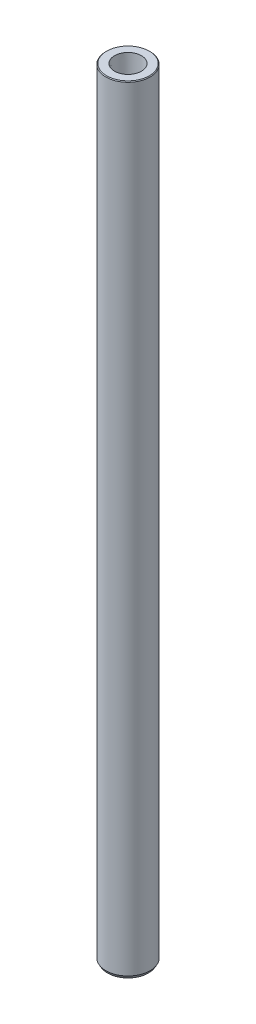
ISO-10303-21;
HEADER;
FILE_DESCRIPTION(('STEP AP214'),'2;1');
FILE_NAME('part.step','',(''),(''),'','','');
FILE_SCHEMA(('AUTOMOTIVE_DESIGN { 1 0 10303 214 1 1 1 1 }'));
ENDSEC;
DATA;
#1=APPLICATION_CONTEXT('core data for automotive mechanical design processes');
#2=APPLICATION_PROTOCOL_DEFINITION('international standard','automotive_design',2000,#1);
#3=PRODUCT_CONTEXT('',#1,'mechanical');
#4=PRODUCT('Part','Part','',(#3));
#5=PRODUCT_RELATED_PRODUCT_CATEGORY('part','',(#4));
#6=PRODUCT_DEFINITION_FORMATION('','',#4);
#7=PRODUCT_DEFINITION_CONTEXT('part definition',#1,'design');
#8=PRODUCT_DEFINITION('design','',#6,#7);
#9=PRODUCT_DEFINITION_SHAPE('','',#8);
#10=(LENGTH_UNIT() NAMED_UNIT(*) SI_UNIT(.MILLI.,.METRE.));
#11=(NAMED_UNIT(*) PLANE_ANGLE_UNIT() SI_UNIT($,.RADIAN.));
#12=(NAMED_UNIT(*) SI_UNIT($,.STERADIAN.) SOLID_ANGLE_UNIT());
#13=UNCERTAINTY_MEASURE_WITH_UNIT(LENGTH_MEASURE(1.E-05),#10,'distance_accuracy_value','');
#14=(GEOMETRIC_REPRESENTATION_CONTEXT(3) GLOBAL_UNCERTAINTY_ASSIGNED_CONTEXT((#13)) GLOBAL_UNIT_ASSIGNED_CONTEXT((#10,
#11,#12)) REPRESENTATION_CONTEXT('',''));
#15=CARTESIAN_POINT('',(0.,0.,0.));
#16=DIRECTION('',(0.,0.,1.));
#17=DIRECTION('',(1.,0.,0.));
#18=AXIS2_PLACEMENT_3D('',#15,#16,#17);
#19=CARTESIAN_POINT('',(0.,264.,0.));
#20=DIRECTION('',(0.,-1.,0.));
#21=DIRECTION('',(0.,0.,-1.));
#22=AXIS2_PLACEMENT_3D('',#19,#20,#21);
#23=CYLINDRICAL_SURFACE('',#22,7.5);
#24=CARTESIAN_POINT('',(0.,263.75,0.));
#25=DIRECTION('',(0.,1.,0.));
#26=DIRECTION('',(0.,0.,1.));
#27=AXIS2_PLACEMENT_3D('',#24,#25,#26);
#28=CIRCLE('',#27,7.5);
#29=CARTESIAN_POINT('',(0.,263.75,7.5));
#30=VERTEX_POINT('',#29);
#31=EDGE_CURVE('E9183',#30,#30,#28,.F.);
#32=ORIENTED_EDGE('',*,*,#31,.T.);
#33=EDGE_LOOP('',(#32));
#34=FACE_BOUND('',#33,.T.);
#35=CARTESIAN_POINT('',(0.,1.00000000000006,0.));
#36=DIRECTION('',(0.,1.,0.));
#37=DIRECTION('',(0.,0.,1.));
#38=AXIS2_PLACEMENT_3D('',#35,#36,#37);
#39=CIRCLE('',#38,7.5);
#40=CARTESIAN_POINT('',(0.,1.00000000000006,7.5));
#41=VERTEX_POINT('',#40);
#42=EDGE_CURVE('E9194',#41,#41,#39,.T.);
#43=ORIENTED_EDGE('',*,*,#42,.T.);
#44=EDGE_LOOP('',(#43));
#45=FACE_BOUND('',#44,.T.);
#46=ADVANCED_FACE('F9172',(#34,#45),#23,.T.);
#47=CARTESIAN_POINT('',(0.,264.,0.));
#48=DIRECTION('',(0.,1.,0.));
#49=DIRECTION('',(0.,0.,1.));
#50=AXIS2_PLACEMENT_3D('',#47,#48,#49);
#51=PLANE('',#50);
#52=CARTESIAN_POINT('',(0.,264.,0.));
#53=DIRECTION('',(0.,1.,0.));
#54=DIRECTION('',(0.,0.,1.));
#55=AXIS2_PLACEMENT_3D('',#52,#53,#54);
#56=CIRCLE('',#55,4.5735);
#57=CARTESIAN_POINT('',(0.,264.,4.5735));
#58=VERTEX_POINT('',#57);
#59=EDGE_CURVE('E9206',#58,#58,#56,.T.);
#60=ORIENTED_EDGE('',*,*,#59,.F.);
#61=EDGE_LOOP('',(#60));
#62=FACE_BOUND('',#61,.T.);
#63=CARTESIAN_POINT('',(0.,264.,0.));
#64=DIRECTION('',(0.,1.,0.));
#65=DIRECTION('',(0.,0.,1.));
#66=AXIS2_PLACEMENT_3D('',#63,#64,#65);
#67=CIRCLE('',#66,7.25000000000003);
#68=CARTESIAN_POINT('',(0.,264.,7.25000000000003));
#69=VERTEX_POINT('',#68);
#70=EDGE_CURVE('E9188',#69,#69,#67,.T.);
#71=ORIENTED_EDGE('',*,*,#70,.T.);
#72=EDGE_LOOP('',(#71));
#73=FACE_BOUND('',#72,.T.);
#74=ADVANCED_FACE('F9212',(#62,#73),#51,.T.);
#75=CARTESIAN_POINT('',(0.,0.,0.));
#76=DIRECTION('',(0.,1.,0.));
#77=DIRECTION('',(0.,0.,1.));
#78=AXIS2_PLACEMENT_3D('',#75,#76,#77);
#79=PLANE('',#78);
#80=CARTESIAN_POINT('',(0.,0.,0.));
#81=DIRECTION('',(0.,1.,0.));
#82=DIRECTION('',(0.,0.,1.));
#83=AXIS2_PLACEMENT_3D('',#80,#81,#82);
#84=CIRCLE('',#83,4.75);
#85=CARTESIAN_POINT('',(0.,0.,4.75));
#86=VERTEX_POINT('',#85);
#87=EDGE_CURVE('E10',#86,#86,#84,.T.);
#88=ORIENTED_EDGE('',*,*,#87,.T.);
#89=EDGE_LOOP('',(#88));
#90=FACE_BOUND('',#89,.T.);
#91=CARTESIAN_POINT('',(0.,0.,0.));
#92=DIRECTION('',(0.,1.,0.));
#93=DIRECTION('',(0.,0.,1.));
#94=AXIS2_PLACEMENT_3D('',#91,#92,#93);
#95=CIRCLE('',#94,6.92264973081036);
#96=CARTESIAN_POINT('',(0.,0.,6.92264973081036));
#97=VERTEX_POINT('',#96);
#98=EDGE_CURVE('E9191',#97,#97,#95,.F.);
#99=ORIENTED_EDGE('',*,*,#98,.T.);
#100=EDGE_LOOP('',(#99));
#101=FACE_BOUND('',#100,.T.);
#102=ADVANCED_FACE('F9215',(#90,#101),#79,.F.);
#103=CARTESIAN_POINT('',(0.,1.00000000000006,0.));
#104=DIRECTION('',(0.,1.,0.));
#105=DIRECTION('',(0.,0.,1.));
#106=AXIS2_PLACEMENT_3D('',#103,#104,#105);
#107=CONICAL_SURFACE('',#106,7.5,0.523598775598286);
#108=ORIENTED_EDGE('',*,*,#98,.F.);
#109=EDGE_LOOP('',(#108));
#110=FACE_BOUND('',#109,.T.);
#111=ORIENTED_EDGE('',*,*,#42,.F.);
#112=EDGE_LOOP('',(#111));
#113=FACE_BOUND('',#112,.T.);
#114=ADVANCED_FACE('F9244',(#110,#113),#107,.T.);
#115=CARTESIAN_POINT('',(0.,17.,0.));
#116=DIRECTION('',(0.,-1.,0.));
#117=DIRECTION('',(0.,0.,-1.));
#118=AXIS2_PLACEMENT_3D('',#115,#116,#117);
#119=CYLINDRICAL_SURFACE('',#118,4.5);
#120=CARTESIAN_POINT('',(0.,0.25,0.));
#121=DIRECTION('',(0.,1.,0.));
#122=DIRECTION('',(0.,0.,1.));
#123=AXIS2_PLACEMENT_3D('',#120,#121,#122);
#124=CIRCLE('',#123,4.5);
#125=CARTESIAN_POINT('',(0.,0.25,4.5));
#126=VERTEX_POINT('',#125);
#127=EDGE_CURVE('E9179',#126,#126,#124,.F.);
#128=ORIENTED_EDGE('',*,*,#127,.T.);
#129=EDGE_LOOP('',(#128));
#130=FACE_BOUND('',#129,.T.);
#131=CARTESIAN_POINT('',(0.,17.,0.));
#132=DIRECTION('',(0.,-1.,0.));
#133=DIRECTION('',(0.,0.,-1.));
#134=AXIS2_PLACEMENT_3D('',#131,#132,#133);
#135=CIRCLE('',#134,4.5);
#136=CARTESIAN_POINT('',(0.,17.,-4.5));
#137=VERTEX_POINT('',#136);
#138=EDGE_CURVE('E9197',#137,#137,#135,.T.);
#139=ORIENTED_EDGE('',*,*,#138,.F.);
#140=EDGE_LOOP('',(#139));
#141=FACE_BOUND('',#140,.T.);
#142=ADVANCED_FACE('F9233',(#130,#141),#119,.F.);
#143=CARTESIAN_POINT('',(0.,17.,0.));
#144=DIRECTION('',(0.,-1.,0.));
#145=DIRECTION('',(0.,0.,-1.));
#146=AXIS2_PLACEMENT_3D('',#143,#144,#145);
#147=PLANE('',#146);
#148=ORIENTED_EDGE('',*,*,#138,.T.);
#149=EDGE_LOOP('',(#148));
#150=FACE_BOUND('',#149,.T.);
#151=ADVANCED_FACE('F9221',(#150),#147,.T.);
#152=CARTESIAN_POINT('',(0.,264.,0.));
#153=DIRECTION('',(0.,-1.,0.));
#154=DIRECTION('',(0.,0.,-1.));
#155=AXIS2_PLACEMENT_3D('',#152,#153,#154);
#156=CONICAL_SURFACE('',#155,7.25000000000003,0.78539816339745);
#157=ORIENTED_EDGE('',*,*,#31,.F.);
#158=EDGE_LOOP('',(#157));
#159=FACE_BOUND('',#158,.T.);
#160=ORIENTED_EDGE('',*,*,#70,.F.);
#161=EDGE_LOOP('',(#160));
#162=FACE_BOUND('',#161,.T.);
#163=ADVANCED_FACE('F9218',(#159,#162),#156,.T.);
#164=CARTESIAN_POINT('',(0.,0.25,0.));
#165=DIRECTION('',(0.,-1.,0.));
#166=DIRECTION('',(0.,0.,-1.));
#167=AXIS2_PLACEMENT_3D('',#164,#165,#166);
#168=CONICAL_SURFACE('',#167,4.5,0.78539816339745);
#169=ORIENTED_EDGE('',*,*,#87,.F.);
#170=EDGE_LOOP('',(#169));
#171=FACE_BOUND('',#170,.T.);
#172=ORIENTED_EDGE('',*,*,#127,.F.);
#173=EDGE_LOOP('',(#172));
#174=FACE_BOUND('',#173,.T.);
#175=ADVANCED_FACE('F9220',(#171,#174),#168,.F.);
#176=CARTESIAN_POINT('',(3.95,256.6,0.));
#177=DIRECTION('',(0.,-1.,0.));
#178=DIRECTION('',(0.,0.,-1.));
#179=AXIS2_PLACEMENT_3D('',#176,#177,#178);
#180=PLANE('',#179);
#181=CARTESIAN_POINT('',(0.,256.6,0.));
#182=DIRECTION('',(0.,1.,0.));
#183=DIRECTION('',(0.,0.,1.));
#184=AXIS2_PLACEMENT_3D('',#181,#182,#183);
#185=CIRCLE('',#184,4.34249700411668);
#186=CARTESIAN_POINT('',(0.,256.6,4.34249700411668));
#187=VERTEX_POINT('',#186);
#188=EDGE_CURVE('E9203',#187,#187,#185,.T.);
#189=ORIENTED_EDGE('',*,*,#188,.T.);
#190=EDGE_LOOP('',(#189));
#191=FACE_BOUND('',#190,.T.);
#192=CARTESIAN_POINT('',(0.,256.6,0.));
#193=DIRECTION('',(0.,-1.,0.));
#194=DIRECTION('',(0.,0.,-1.));
#195=AXIS2_PLACEMENT_3D('',#192,#193,#194);
#196=CIRCLE('',#195,4.);
#197=CARTESIAN_POINT('',(0.,256.6,-4.));
#198=VERTEX_POINT('',#197);
#199=EDGE_CURVE('E9175',#198,#198,#196,.F.);
#200=ORIENTED_EDGE('',*,*,#199,.F.);
#201=EDGE_LOOP('',(#200));
#202=FACE_BOUND('',#201,.T.);
#203=ADVANCED_FACE('F9229',(#191,#202),#180,.F.);
#204=CARTESIAN_POINT('',(0.,264.,0.));
#205=DIRECTION('',(0.,1.,0.));
#206=DIRECTION('',(0.,0.,1.));
#207=AXIS2_PLACEMENT_3D('',#204,#205,#206);
#208=CONICAL_SURFACE('',#207,4.5735,0.0312064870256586);
#209=ORIENTED_EDGE('',*,*,#188,.F.);
#210=EDGE_LOOP('',(#209));
#211=FACE_BOUND('',#210,.T.);
#212=ORIENTED_EDGE('',*,*,#59,.T.);
#213=EDGE_LOOP('',(#212));
#214=FACE_BOUND('',#213,.T.);
#215=ADVANCED_FACE('F9210',(#211,#214),#208,.F.);
#216=CARTESIAN_POINT('',(0.,64.,0.));
#217=DIRECTION('',(0.,1.,0.));
#218=DIRECTION('',(0.,0.,1.));
#219=AXIS2_PLACEMENT_3D('',#216,#217,#218);
#220=PLANE('',#219);
#221=CARTESIAN_POINT('',(0.,64.,0.));
#222=DIRECTION('',(0.,1.,0.));
#223=DIRECTION('',(0.,0.,1.));
#224=AXIS2_PLACEMENT_3D('',#221,#222,#223);
#225=CIRCLE('',#224,4.);
#226=CARTESIAN_POINT('',(0.,64.,4.));
#227=VERTEX_POINT('',#226);
#228=EDGE_CURVE('E9200',#227,#227,#225,.T.);
#229=ORIENTED_EDGE('',*,*,#228,.T.);
#230=EDGE_LOOP('',(#229));
#231=FACE_BOUND('',#230,.T.);
#232=ADVANCED_FACE('F9262',(#231),#220,.T.);
#233=CARTESIAN_POINT('',(0.,64.,0.));
#234=DIRECTION('',(0.,1.,0.));
#235=DIRECTION('',(0.,0.,1.));
#236=AXIS2_PLACEMENT_3D('',#233,#234,#235);
#237=CYLINDRICAL_SURFACE('',#236,4.);
#238=ORIENTED_EDGE('',*,*,#199,.T.);
#239=EDGE_LOOP('',(#238));
#240=FACE_BOUND('',#239,.T.);
#241=ORIENTED_EDGE('',*,*,#228,.F.);
#242=EDGE_LOOP('',(#241));
#243=FACE_BOUND('',#242,.T.);
#244=ADVANCED_FACE('F9292',(#240,#243),#237,.F.);
#245=CLOSED_SHELL('',(#46,#74,#102,#114,#142,#151,#163,#175,#203,#215,#232,#244));
#246=MANIFOLD_SOLID_BREP('B2',#245);
#247=ADVANCED_BREP_SHAPE_REPRESENTATION('',(#18,#246),#14);
#248=SHAPE_DEFINITION_REPRESENTATION(#9,#247);
ENDSEC;
END-ISO-10303-21;
